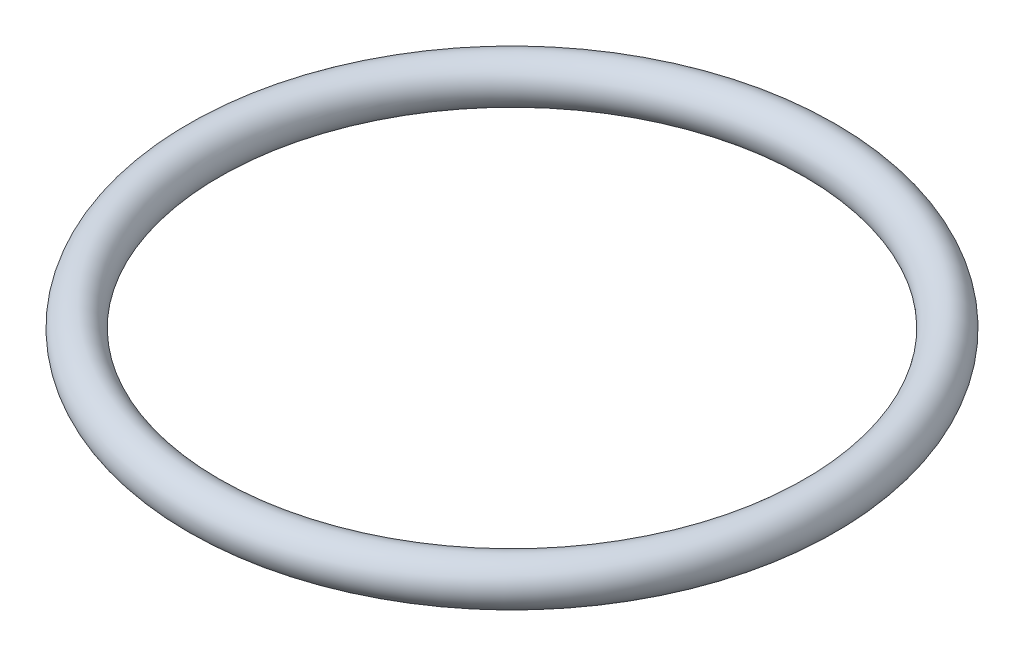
ISO-10303-21;
HEADER;
FILE_DESCRIPTION(('STEP AP214'),'2;1');
FILE_NAME('part.step','',(''),(''),'','','');
FILE_SCHEMA(('AUTOMOTIVE_DESIGN { 1 0 10303 214 1 1 1 1 }'));
ENDSEC;
DATA;
#1=APPLICATION_CONTEXT('core data for automotive mechanical design processes');
#2=APPLICATION_PROTOCOL_DEFINITION('international standard','automotive_design',2000,#1);
#3=PRODUCT_CONTEXT('',#1,'mechanical');
#4=PRODUCT('Part','Part','',(#3));
#5=PRODUCT_RELATED_PRODUCT_CATEGORY('part','',(#4));
#6=PRODUCT_DEFINITION_FORMATION('','',#4);
#7=PRODUCT_DEFINITION_CONTEXT('part definition',#1,'design');
#8=PRODUCT_DEFINITION('design','',#6,#7);
#9=PRODUCT_DEFINITION_SHAPE('','',#8);
#10=(LENGTH_UNIT() NAMED_UNIT(*) SI_UNIT(.MILLI.,.METRE.));
#11=(NAMED_UNIT(*) PLANE_ANGLE_UNIT() SI_UNIT($,.RADIAN.));
#12=(NAMED_UNIT(*) SI_UNIT($,.STERADIAN.) SOLID_ANGLE_UNIT());
#13=UNCERTAINTY_MEASURE_WITH_UNIT(LENGTH_MEASURE(1.E-05),#10,'distance_accuracy_value','');
#14=(GEOMETRIC_REPRESENTATION_CONTEXT(3) GLOBAL_UNCERTAINTY_ASSIGNED_CONTEXT((#13)) GLOBAL_UNIT_ASSIGNED_CONTEXT((#10,
#11,#12)) REPRESENTATION_CONTEXT('',''));
#15=CARTESIAN_POINT('',(0.,0.,0.));
#16=DIRECTION('',(0.,0.,1.));
#17=DIRECTION('',(1.,0.,0.));
#18=AXIS2_PLACEMENT_3D('',#15,#16,#17);
#19=CARTESIAN_POINT('',(0.,206.41,0.));
#20=DIRECTION('',(0.,-1.,0.));
#21=DIRECTION('',(0.,0.,-1.));
#22=AXIS2_PLACEMENT_3D('',#19,#20,#21);
#23=TOROIDAL_SURFACE('',#22,18.605,1.30999999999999);
#24=CARTESIAN_POINT('',(0.,206.41,-19.915));
#25=VERTEX_POINT('',#24);
#26=VERTEX_LOOP('',#25);
#27=FACE_BOUND('',#26,.T.);
#28=ADVANCED_FACE('F28',(#27),#23,.T.);
#29=CLOSED_SHELL('',(#28));
#30=MANIFOLD_SOLID_BREP('B2',#29);
#31=ADVANCED_BREP_SHAPE_REPRESENTATION('',(#18,#30),#14);
#32=SHAPE_DEFINITION_REPRESENTATION(#9,#31);
ENDSEC;
END-ISO-10303-21;
